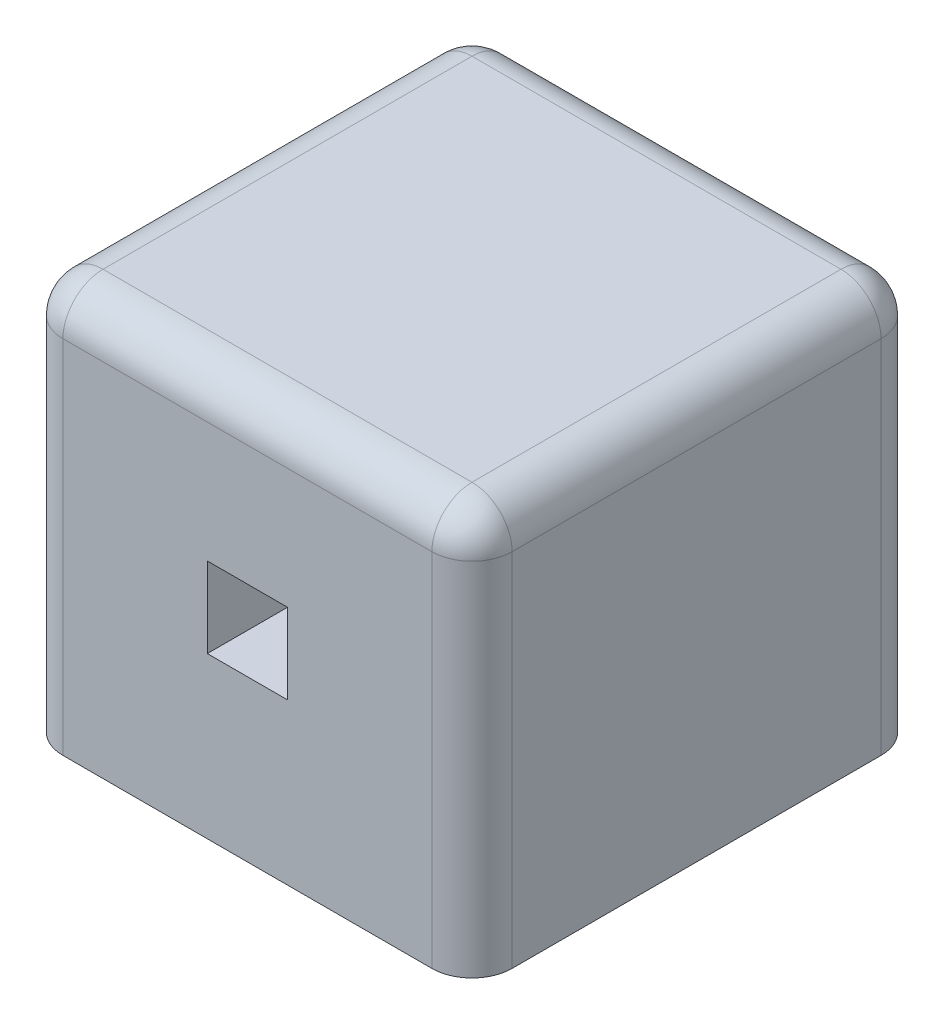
ISO-10303-21;
HEADER;
FILE_DESCRIPTION(('STEP AP214'),'2;1');
FILE_NAME('part.step','',(''),(''),'','','');
FILE_SCHEMA(('AUTOMOTIVE_DESIGN { 1 0 10303 214 1 1 1 1 }'));
ENDSEC;
DATA;
#1=APPLICATION_CONTEXT('core data for automotive mechanical design processes');
#2=APPLICATION_PROTOCOL_DEFINITION('international standard','automotive_design',2000,#1);
#3=PRODUCT_CONTEXT('',#1,'mechanical');
#4=PRODUCT('Part','Part','',(#3));
#5=PRODUCT_RELATED_PRODUCT_CATEGORY('part','',(#4));
#6=PRODUCT_DEFINITION_FORMATION('','',#4);
#7=PRODUCT_DEFINITION_CONTEXT('part definition',#1,'design');
#8=PRODUCT_DEFINITION('design','',#6,#7);
#9=PRODUCT_DEFINITION_SHAPE('','',#8);
#10=(LENGTH_UNIT() NAMED_UNIT(*) SI_UNIT(.MILLI.,.METRE.));
#11=(NAMED_UNIT(*) PLANE_ANGLE_UNIT() SI_UNIT($,.RADIAN.));
#12=(NAMED_UNIT(*) SI_UNIT($,.STERADIAN.) SOLID_ANGLE_UNIT());
#13=UNCERTAINTY_MEASURE_WITH_UNIT(LENGTH_MEASURE(1.E-05),#10,'distance_accuracy_value','');
#14=(GEOMETRIC_REPRESENTATION_CONTEXT(3) GLOBAL_UNCERTAINTY_ASSIGNED_CONTEXT((#13)) GLOBAL_UNIT_ASSIGNED_CONTEXT((#10,
#11,#12)) REPRESENTATION_CONTEXT('',''));
#15=CARTESIAN_POINT('',(0.,0.,0.));
#16=DIRECTION('',(0.,0.,1.));
#17=DIRECTION('',(1.,0.,0.));
#18=AXIS2_PLACEMENT_3D('',#15,#16,#17);
#19=CARTESIAN_POINT('',(0.,0.,80.));
#20=DIRECTION('',(0.,0.,1.));
#21=DIRECTION('',(1.,0.,0.));
#22=AXIS2_PLACEMENT_3D('',#19,#20,#21);
#23=PLANE('',#22);
#24=DIRECTION('',(1.,0.,0.));
#25=VECTOR('',#24,1.);
#26=CARTESIAN_POINT('',(40.,-35.7142857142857,80.));
#27=LINE('',#26,#25);
#28=CARTESIAN_POINT('',(-32.8571428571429,-35.7142857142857,80.));
#29=VERTEX_POINT('',#28);
#30=CARTESIAN_POINT('',(32.8571428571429,-35.7142857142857,80.));
#31=VERTEX_POINT('',#30);
#32=EDGE_CURVE('E197',#29,#31,#27,.T.);
#33=ORIENTED_EDGE('',*,*,#32,.T.);
#34=DIRECTION('',(0.,1.,0.));
#35=VECTOR('',#34,1.);
#36=CARTESIAN_POINT('',(32.8571428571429,35.7142857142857,80.));
#37=LINE('',#36,#35);
#38=CARTESIAN_POINT('',(32.8571428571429,28.5714285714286,80.));
#39=VERTEX_POINT('',#38);
#40=EDGE_CURVE('E250',#31,#39,#37,.T.);
#41=ORIENTED_EDGE('',*,*,#40,.T.);
#42=DIRECTION('',(-1.,0.,0.));
#43=VECTOR('',#42,1.);
#44=CARTESIAN_POINT('',(-40.,28.5714285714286,80.));
#45=LINE('',#44,#43);
#46=CARTESIAN_POINT('',(-32.8571428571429,28.5714285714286,80.));
#47=VERTEX_POINT('',#46);
#48=EDGE_CURVE('E247',#39,#47,#45,.T.);
#49=ORIENTED_EDGE('',*,*,#48,.T.);
#50=DIRECTION('',(0.,-1.,0.));
#51=VECTOR('',#50,1.);
#52=CARTESIAN_POINT('',(-32.8571428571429,-35.7142857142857,80.));
#53=LINE('',#52,#51);
#54=EDGE_CURVE('E244',#47,#29,#53,.T.);
#55=ORIENTED_EDGE('',*,*,#54,.T.);
#56=EDGE_LOOP('',(#33,#41,#49,#55));
#57=FACE_BOUND('',#56,.T.);
#58=DIRECTION('',(1.,0.,0.));
#59=VECTOR('',#58,1.);
#60=CARTESIAN_POINT('',(7.14285714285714,-7.14285714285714,80.));
#61=LINE('',#60,#59);
#62=CARTESIAN_POINT('',(-7.14285714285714,-7.14285714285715,80.));
#63=VERTEX_POINT('',#62);
#64=CARTESIAN_POINT('',(7.14285714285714,-7.14285714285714,80.));
#65=VERTEX_POINT('',#64);
#66=EDGE_CURVE('E153',#63,#65,#61,.T.);
#67=ORIENTED_EDGE('',*,*,#66,.F.);
#68=DIRECTION('',(0.,-1.,0.));
#69=VECTOR('',#68,1.);
#70=CARTESIAN_POINT('',(-7.14285714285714,-7.14285714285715,80.));
#71=LINE('',#70,#69);
#72=CARTESIAN_POINT('',(-7.14285714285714,7.14285714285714,80.));
#73=VERTEX_POINT('',#72);
#74=EDGE_CURVE('E142',#73,#63,#71,.T.);
#75=ORIENTED_EDGE('',*,*,#74,.F.);
#76=DIRECTION('',(-1.,0.,0.));
#77=VECTOR('',#76,1.);
#78=CARTESIAN_POINT('',(7.14285714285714,7.14285714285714,80.));
#79=LINE('',#78,#77);
#80=CARTESIAN_POINT('',(7.14285714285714,7.14285714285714,80.));
#81=VERTEX_POINT('',#80);
#82=EDGE_CURVE('E171',#81,#73,#79,.T.);
#83=ORIENTED_EDGE('',*,*,#82,.F.);
#84=DIRECTION('',(0.,1.,0.));
#85=VECTOR('',#84,1.);
#86=CARTESIAN_POINT('',(7.14285714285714,-7.14285714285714,80.));
#87=LINE('',#86,#85);
#88=EDGE_CURVE('E167',#65,#81,#87,.T.);
#89=ORIENTED_EDGE('',*,*,#88,.F.);
#90=EDGE_LOOP('',(#67,#75,#83,#89));
#91=FACE_BOUND('',#90,.T.);
#92=ADVANCED_FACE('F39',(#57,#91),#23,.T.);
#93=CARTESIAN_POINT('',(0.,0.,0.));
#94=DIRECTION('',(0.,0.,1.));
#95=DIRECTION('',(1.,0.,0.));
#96=AXIS2_PLACEMENT_3D('',#93,#94,#95);
#97=PLANE('',#96);
#98=DIRECTION('',(-1.,0.,0.));
#99=VECTOR('',#98,1.);
#100=CARTESIAN_POINT('',(0.,28.5714285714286,0.));
#101=LINE('',#100,#99);
#102=CARTESIAN_POINT('',(-32.8571428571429,28.5714285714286,0.));
#103=VERTEX_POINT('',#102);
#104=CARTESIAN_POINT('',(32.8571428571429,28.5714285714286,0.));
#105=VERTEX_POINT('',#104);
#106=EDGE_CURVE('E228',#103,#105,#101,.F.);
#107=ORIENTED_EDGE('',*,*,#106,.T.);
#108=DIRECTION('',(0.,1.,0.));
#109=VECTOR('',#108,1.);
#110=CARTESIAN_POINT('',(32.8571428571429,0.,0.));
#111=LINE('',#110,#109);
#112=CARTESIAN_POINT('',(32.8571428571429,-35.7142857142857,0.));
#113=VERTEX_POINT('',#112);
#114=EDGE_CURVE('E232',#105,#113,#111,.F.);
#115=ORIENTED_EDGE('',*,*,#114,.T.);
#116=DIRECTION('',(1.,0.,0.));
#117=VECTOR('',#116,1.);
#118=CARTESIAN_POINT('',(40.,-35.7142857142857,0.));
#119=LINE('',#118,#117);
#120=CARTESIAN_POINT('',(-32.8571428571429,-35.7142857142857,0.));
#121=VERTEX_POINT('',#120);
#122=EDGE_CURVE('E162',#121,#113,#119,.T.);
#123=ORIENTED_EDGE('',*,*,#122,.F.);
#124=DIRECTION('',(0.,-1.,0.));
#125=VECTOR('',#124,1.);
#126=CARTESIAN_POINT('',(-32.8571428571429,0.,0.));
#127=LINE('',#126,#125);
#128=EDGE_CURVE('E225',#121,#103,#127,.F.);
#129=ORIENTED_EDGE('',*,*,#128,.T.);
#130=EDGE_LOOP('',(#107,#115,#123,#129));
#131=FACE_BOUND('',#130,.T.);
#132=DIRECTION('',(0.,-1.,0.));
#133=VECTOR('',#132,1.);
#134=CARTESIAN_POINT('',(-7.14285714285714,-7.14285714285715,0.));
#135=LINE('',#134,#133);
#136=CARTESIAN_POINT('',(-7.14285714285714,7.14285714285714,0.));
#137=VERTEX_POINT('',#136);
#138=CARTESIAN_POINT('',(-7.14285714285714,-7.14285714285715,0.));
#139=VERTEX_POINT('',#138);
#140=EDGE_CURVE('E177',#137,#139,#135,.T.);
#141=ORIENTED_EDGE('',*,*,#140,.T.);
#142=DIRECTION('',(1.,0.,0.));
#143=VECTOR('',#142,1.);
#144=CARTESIAN_POINT('',(7.14285714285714,-7.14285714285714,0.));
#145=LINE('',#144,#143);
#146=CARTESIAN_POINT('',(7.14285714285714,-7.14285714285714,0.));
#147=VERTEX_POINT('',#146);
#148=EDGE_CURVE('E160',#139,#147,#145,.T.);
#149=ORIENTED_EDGE('',*,*,#148,.T.);
#150=DIRECTION('',(0.,1.,0.));
#151=VECTOR('',#150,1.);
#152=CARTESIAN_POINT('',(7.14285714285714,-7.14285714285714,0.));
#153=LINE('',#152,#151);
#154=CARTESIAN_POINT('',(7.14285714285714,7.14285714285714,0.));
#155=VERTEX_POINT('',#154);
#156=EDGE_CURVE('E183',#147,#155,#153,.T.);
#157=ORIENTED_EDGE('',*,*,#156,.T.);
#158=DIRECTION('',(-1.,0.,0.));
#159=VECTOR('',#158,1.);
#160=CARTESIAN_POINT('',(7.14285714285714,7.14285714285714,0.));
#161=LINE('',#160,#159);
#162=EDGE_CURVE('E154',#155,#137,#161,.T.);
#163=ORIENTED_EDGE('',*,*,#162,.T.);
#164=EDGE_LOOP('',(#141,#149,#157,#163));
#165=FACE_BOUND('',#164,.T.);
#166=ADVANCED_FACE('F365',(#131,#165),#97,.F.);
#167=CARTESIAN_POINT('',(-40.,-35.7142857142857,80.));
#168=DIRECTION('',(1.,0.,0.));
#169=DIRECTION('',(0.,0.,-1.));
#170=AXIS2_PLACEMENT_3D('',#167,#168,#169);
#171=PLANE('',#170);
#172=DIRECTION('',(0.,0.,-1.));
#173=VECTOR('',#172,1.);
#174=CARTESIAN_POINT('',(-40.,-35.7142857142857,80.));
#175=LINE('',#174,#173);
#176=CARTESIAN_POINT('',(-40.,-35.7142857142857,72.8571428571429));
#177=VERTEX_POINT('',#176);
#178=CARTESIAN_POINT('',(-40.,-35.7142857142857,7.14285714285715));
#179=VERTEX_POINT('',#178);
#180=EDGE_CURVE('E208',#177,#179,#175,.T.);
#181=ORIENTED_EDGE('',*,*,#180,.F.);
#182=DIRECTION('',(0.,-1.,0.));
#183=VECTOR('',#182,1.);
#184=CARTESIAN_POINT('',(-40.,35.7142857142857,72.8571428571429));
#185=LINE('',#184,#183);
#186=CARTESIAN_POINT('',(-40.,28.5714285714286,72.8571428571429));
#187=VERTEX_POINT('',#186);
#188=EDGE_CURVE('E55',#177,#187,#185,.F.);
#189=ORIENTED_EDGE('',*,*,#188,.T.);
#190=DIRECTION('',(0.,0.,-1.));
#191=VECTOR('',#190,1.);
#192=CARTESIAN_POINT('',(-40.,28.5714285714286,80.));
#193=LINE('',#192,#191);
#194=CARTESIAN_POINT('',(-40.,28.5714285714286,7.14285714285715));
#195=VERTEX_POINT('',#194);
#196=EDGE_CURVE('E60',#187,#195,#193,.T.);
#197=ORIENTED_EDGE('',*,*,#196,.T.);
#198=DIRECTION('',(0.,-1.,0.));
#199=VECTOR('',#198,1.);
#200=CARTESIAN_POINT('',(-40.,-35.7142857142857,7.14285714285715));
#201=LINE('',#200,#199);
#202=EDGE_CURVE('E253',#195,#179,#201,.T.);
#203=ORIENTED_EDGE('',*,*,#202,.T.);
#204=EDGE_LOOP('',(#181,#189,#197,#203));
#205=FACE_BOUND('',#204,.T.);
#206=ADVANCED_FACE('F350',(#205),#171,.F.);
#207=CARTESIAN_POINT('',(40.,-35.7142857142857,80.));
#208=DIRECTION('',(0.,1.,0.));
#209=DIRECTION('',(0.,0.,1.));
#210=AXIS2_PLACEMENT_3D('',#207,#208,#209);
#211=PLANE('',#210);
#212=CARTESIAN_POINT('',(0.,-35.7142857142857,40.));
#213=DIRECTION('',(0.,1.,0.));
#214=DIRECTION('',(0.,0.,1.));
#215=AXIS2_PLACEMENT_3D('',#212,#213,#214);
#216=CIRCLE('',#215,5.);
#217=CARTESIAN_POINT('',(0.,-35.7142857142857,45.));
#218=VERTEX_POINT('',#217);
#219=EDGE_CURVE('E11',#218,#218,#216,.F.);
#220=ORIENTED_EDGE('',*,*,#219,.F.);
#221=EDGE_LOOP('',(#220));
#222=FACE_BOUND('',#221,.T.);
#223=DIRECTION('',(0.,0.,-1.));
#224=VECTOR('',#223,1.);
#225=CARTESIAN_POINT('',(40.,-35.7142857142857,80.));
#226=LINE('',#225,#224);
#227=CARTESIAN_POINT('',(40.,-35.7142857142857,72.8571428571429));
#228=VERTEX_POINT('',#227);
#229=CARTESIAN_POINT('',(40.,-35.7142857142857,7.14285714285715));
#230=VERTEX_POINT('',#229);
#231=EDGE_CURVE('E201',#228,#230,#226,.T.);
#232=ORIENTED_EDGE('',*,*,#231,.F.);
#233=CARTESIAN_POINT('',(32.8571428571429,-35.7142857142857,72.8571428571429));
#234=DIRECTION('',(0.,1.,0.));
#235=DIRECTION('',(0.,0.,1.));
#236=AXIS2_PLACEMENT_3D('',#233,#234,#235);
#237=CIRCLE('',#236,7.14285714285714);
#238=EDGE_CURVE('E48',#228,#31,#237,.F.);
#239=ORIENTED_EDGE('',*,*,#238,.T.);
#240=ORIENTED_EDGE('',*,*,#32,.F.);
#241=CARTESIAN_POINT('',(-32.8571428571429,-35.7142857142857,72.8571428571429));
#242=DIRECTION('',(0.,1.,0.));
#243=DIRECTION('',(0.,0.,1.));
#244=AXIS2_PLACEMENT_3D('',#241,#242,#243);
#245=CIRCLE('',#244,7.14285714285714);
#246=EDGE_CURVE('E266',#29,#177,#245,.F.);
#247=ORIENTED_EDGE('',*,*,#246,.T.);
#248=ORIENTED_EDGE('',*,*,#180,.T.);
#249=CARTESIAN_POINT('',(-32.8571428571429,-35.7142857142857,7.14285714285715));
#250=DIRECTION('',(0.,1.,0.));
#251=DIRECTION('',(0.,0.,1.));
#252=AXIS2_PLACEMENT_3D('',#249,#250,#251);
#253=CIRCLE('',#252,7.14285714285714);
#254=EDGE_CURVE('E260',#179,#121,#253,.F.);
#255=ORIENTED_EDGE('',*,*,#254,.T.);
#256=ORIENTED_EDGE('',*,*,#122,.T.);
#257=CARTESIAN_POINT('',(32.8571428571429,-35.7142857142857,7.14285714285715));
#258=DIRECTION('',(0.,1.,0.));
#259=DIRECTION('',(0.,0.,1.));
#260=AXIS2_PLACEMENT_3D('',#257,#258,#259);
#261=CIRCLE('',#260,7.14285714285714);
#262=EDGE_CURVE('E263',#113,#230,#261,.F.);
#263=ORIENTED_EDGE('',*,*,#262,.T.);
#264=EDGE_LOOP('',(#232,#239,#240,#247,#248,#255,#256,#263));
#265=FACE_BOUND('',#264,.T.);
#266=ADVANCED_FACE('F348',(#222,#265),#211,.F.);
#267=CARTESIAN_POINT('',(40.,-35.7142857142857,80.));
#268=DIRECTION('',(-1.,0.,0.));
#269=DIRECTION('',(0.,0.,1.));
#270=AXIS2_PLACEMENT_3D('',#267,#268,#269);
#271=PLANE('',#270);
#272=DIRECTION('',(0.,0.,-1.));
#273=VECTOR('',#272,1.);
#274=CARTESIAN_POINT('',(40.,28.5714285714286,80.));
#275=LINE('',#274,#273);
#276=CARTESIAN_POINT('',(40.,28.5714285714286,7.14285714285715));
#277=VERTEX_POINT('',#276);
#278=CARTESIAN_POINT('',(40.,28.5714285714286,72.8571428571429));
#279=VERTEX_POINT('',#278);
#280=EDGE_CURVE('E238',#277,#279,#275,.F.);
#281=ORIENTED_EDGE('',*,*,#280,.T.);
#282=DIRECTION('',(0.,1.,0.));
#283=VECTOR('',#282,1.);
#284=CARTESIAN_POINT('',(40.,-35.7142857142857,72.8571428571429));
#285=LINE('',#284,#283);
#286=EDGE_CURVE('E241',#279,#228,#285,.F.);
#287=ORIENTED_EDGE('',*,*,#286,.T.);
#288=ORIENTED_EDGE('',*,*,#231,.T.);
#289=DIRECTION('',(0.,1.,0.));
#290=VECTOR('',#289,1.);
#291=CARTESIAN_POINT('',(40.,-35.7142857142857,7.14285714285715));
#292=LINE('',#291,#290);
#293=EDGE_CURVE('E235',#230,#277,#292,.T.);
#294=ORIENTED_EDGE('',*,*,#293,.T.);
#295=EDGE_LOOP('',(#281,#287,#288,#294));
#296=FACE_BOUND('',#295,.T.);
#297=ADVANCED_FACE('F374',(#296),#271,.F.);
#298=CARTESIAN_POINT('',(40.,35.7142857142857,80.));
#299=DIRECTION('',(0.,-1.,0.));
#300=DIRECTION('',(0.,0.,-1.));
#301=AXIS2_PLACEMENT_3D('',#298,#299,#300);
#302=PLANE('',#301);
#303=DIRECTION('',(0.,0.,-1.));
#304=VECTOR('',#303,1.);
#305=CARTESIAN_POINT('',(32.8571428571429,35.7142857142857,80.));
#306=LINE('',#305,#304);
#307=CARTESIAN_POINT('',(32.8571428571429,35.7142857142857,72.8571428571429));
#308=VERTEX_POINT('',#307);
#309=CARTESIAN_POINT('',(32.8571428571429,35.7142857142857,7.14285714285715));
#310=VERTEX_POINT('',#309);
#311=EDGE_CURVE('E218',#308,#310,#306,.T.);
#312=ORIENTED_EDGE('',*,*,#311,.T.);
#313=DIRECTION('',(-1.,0.,0.));
#314=VECTOR('',#313,1.);
#315=CARTESIAN_POINT('',(40.,35.7142857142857,7.14285714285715));
#316=LINE('',#315,#314);
#317=CARTESIAN_POINT('',(-32.8571428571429,35.7142857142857,7.14285714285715));
#318=VERTEX_POINT('',#317);
#319=EDGE_CURVE('E221',#310,#318,#316,.T.);
#320=ORIENTED_EDGE('',*,*,#319,.T.);
#321=DIRECTION('',(0.,0.,-1.));
#322=VECTOR('',#321,1.);
#323=CARTESIAN_POINT('',(-32.8571428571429,35.7142857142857,80.));
#324=LINE('',#323,#322);
#325=CARTESIAN_POINT('',(-32.8571428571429,35.7142857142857,72.8571428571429));
#326=VERTEX_POINT('',#325);
#327=EDGE_CURVE('E212',#318,#326,#324,.F.);
#328=ORIENTED_EDGE('',*,*,#327,.T.);
#329=DIRECTION('',(-1.,0.,0.));
#330=VECTOR('',#329,1.);
#331=CARTESIAN_POINT('',(40.,35.7142857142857,72.8571428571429));
#332=LINE('',#331,#330);
#333=EDGE_CURVE('E215',#326,#308,#332,.F.);
#334=ORIENTED_EDGE('',*,*,#333,.T.);
#335=EDGE_LOOP('',(#312,#320,#328,#334));
#336=FACE_BOUND('',#335,.T.);
#337=ADVANCED_FACE('F331',(#336),#302,.F.);
#338=CARTESIAN_POINT('',(-7.14285714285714,-7.14285714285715,80.));
#339=DIRECTION('',(1.,0.,0.));
#340=DIRECTION('',(0.,0.,-1.));
#341=AXIS2_PLACEMENT_3D('',#338,#339,#340);
#342=PLANE('',#341);
#343=ORIENTED_EDGE('',*,*,#140,.F.);
#344=DIRECTION('',(0.,0.,-1.));
#345=VECTOR('',#344,1.);
#346=CARTESIAN_POINT('',(-7.14285714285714,7.14285714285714,80.));
#347=LINE('',#346,#345);
#348=EDGE_CURVE('E148',#73,#137,#347,.T.);
#349=ORIENTED_EDGE('',*,*,#348,.F.);
#350=ORIENTED_EDGE('',*,*,#74,.T.);
#351=DIRECTION('',(0.,0.,-1.));
#352=VECTOR('',#351,1.);
#353=CARTESIAN_POINT('',(-7.14285714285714,-7.14285714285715,80.));
#354=LINE('',#353,#352);
#355=EDGE_CURVE('E145',#63,#139,#354,.T.);
#356=ORIENTED_EDGE('',*,*,#355,.T.);
#357=EDGE_LOOP('',(#343,#349,#350,#356));
#358=FACE_BOUND('',#357,.T.);
#359=ADVANCED_FACE('F144',(#358),#342,.T.);
#360=CARTESIAN_POINT('',(7.14285714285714,-7.14285714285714,80.));
#361=DIRECTION('',(0.,1.,0.));
#362=DIRECTION('',(-1.,0.,0.));
#363=AXIS2_PLACEMENT_3D('',#360,#361,#362);
#364=PLANE('',#363);
#365=ORIENTED_EDGE('',*,*,#148,.F.);
#366=ORIENTED_EDGE('',*,*,#355,.F.);
#367=ORIENTED_EDGE('',*,*,#66,.T.);
#368=DIRECTION('',(0.,0.,-1.));
#369=VECTOR('',#368,1.);
#370=CARTESIAN_POINT('',(7.14285714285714,-7.14285714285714,80.));
#371=LINE('',#370,#369);
#372=EDGE_CURVE('E163',#65,#147,#371,.T.);
#373=ORIENTED_EDGE('',*,*,#372,.T.);
#374=EDGE_LOOP('',(#365,#366,#367,#373));
#375=FACE_BOUND('',#374,.T.);
#376=ADVANCED_FACE('F157',(#375),#364,.T.);
#377=CARTESIAN_POINT('',(7.14285714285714,-7.14285714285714,80.));
#378=DIRECTION('',(-1.,0.,0.));
#379=DIRECTION('',(0.,0.,1.));
#380=AXIS2_PLACEMENT_3D('',#377,#378,#379);
#381=PLANE('',#380);
#382=ORIENTED_EDGE('',*,*,#156,.F.);
#383=ORIENTED_EDGE('',*,*,#372,.F.);
#384=ORIENTED_EDGE('',*,*,#88,.T.);
#385=DIRECTION('',(0.,0.,-1.));
#386=VECTOR('',#385,1.);
#387=CARTESIAN_POINT('',(7.14285714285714,7.14285714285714,80.));
#388=LINE('',#387,#386);
#389=EDGE_CURVE('E192',#81,#155,#388,.T.);
#390=ORIENTED_EDGE('',*,*,#389,.T.);
#391=EDGE_LOOP('',(#382,#383,#384,#390));
#392=FACE_BOUND('',#391,.T.);
#393=ADVANCED_FACE('F382',(#392),#381,.T.);
#394=CARTESIAN_POINT('',(7.14285714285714,7.14285714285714,80.));
#395=DIRECTION('',(0.,-1.,0.));
#396=DIRECTION('',(1.,0.,0.));
#397=AXIS2_PLACEMENT_3D('',#394,#395,#396);
#398=PLANE('',#397);
#399=ORIENTED_EDGE('',*,*,#162,.F.);
#400=ORIENTED_EDGE('',*,*,#389,.F.);
#401=ORIENTED_EDGE('',*,*,#82,.T.);
#402=ORIENTED_EDGE('',*,*,#348,.T.);
#403=EDGE_LOOP('',(#399,#400,#401,#402));
#404=FACE_BOUND('',#403,.T.);
#405=ADVANCED_FACE('F377',(#404),#398,.T.);
#406=CARTESIAN_POINT('',(32.8571428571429,0.,72.8571428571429));
#407=DIRECTION('',(0.,-1.,0.));
#408=DIRECTION('',(0.,0.,-1.));
#409=AXIS2_PLACEMENT_3D('',#406,#407,#408);
#410=CYLINDRICAL_SURFACE('',#409,7.14285714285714);
#411=ORIENTED_EDGE('',*,*,#238,.F.);
#412=ORIENTED_EDGE('',*,*,#286,.F.);
#413=CARTESIAN_POINT('',(32.8571428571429,28.5714285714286,72.8571428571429));
#414=DIRECTION('',(0.,1.,0.));
#415=DIRECTION('',(0.,0.,1.));
#416=AXIS2_PLACEMENT_3D('',#413,#414,#415);
#417=CIRCLE('',#416,7.14285714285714);
#418=EDGE_CURVE('E180',#39,#279,#417,.T.);
#419=ORIENTED_EDGE('',*,*,#418,.F.);
#420=ORIENTED_EDGE('',*,*,#40,.F.);
#421=EDGE_LOOP('',(#411,#412,#419,#420));
#422=FACE_BOUND('',#421,.T.);
#423=ADVANCED_FACE('F41',(#422),#410,.T.);
#424=CARTESIAN_POINT('',(0.,28.5714285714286,72.8571428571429));
#425=DIRECTION('',(1.,0.,0.));
#426=DIRECTION('',(0.,0.,-1.));
#427=AXIS2_PLACEMENT_3D('',#424,#425,#426);
#428=CYLINDRICAL_SURFACE('',#427,7.14285714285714);
#429=CARTESIAN_POINT('',(-32.8571428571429,28.5714285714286,72.8571428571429));
#430=DIRECTION('',(-1.,0.,0.));
#431=DIRECTION('',(0.,0.,1.));
#432=AXIS2_PLACEMENT_3D('',#429,#430,#431);
#433=CIRCLE('',#432,7.14285714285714);
#434=EDGE_CURVE('E306',#47,#326,#433,.T.);
#435=ORIENTED_EDGE('',*,*,#434,.F.);
#436=ORIENTED_EDGE('',*,*,#48,.F.);
#437=CARTESIAN_POINT('',(32.8571428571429,28.5714285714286,72.8571428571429));
#438=DIRECTION('',(1.,0.,0.));
#439=DIRECTION('',(0.,0.,-1.));
#440=AXIS2_PLACEMENT_3D('',#437,#438,#439);
#441=CIRCLE('',#440,7.14285714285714);
#442=EDGE_CURVE('E310',#308,#39,#441,.T.);
#443=ORIENTED_EDGE('',*,*,#442,.F.);
#444=ORIENTED_EDGE('',*,*,#333,.F.);
#445=EDGE_LOOP('',(#435,#436,#443,#444));
#446=FACE_BOUND('',#445,.T.);
#447=ADVANCED_FACE('F338',(#446),#428,.T.);
#448=CARTESIAN_POINT('',(-32.8571428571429,0.,72.8571428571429));
#449=DIRECTION('',(0.,1.,0.));
#450=DIRECTION('',(0.,0.,1.));
#451=AXIS2_PLACEMENT_3D('',#448,#449,#450);
#452=CYLINDRICAL_SURFACE('',#451,7.14285714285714);
#453=ORIENTED_EDGE('',*,*,#246,.F.);
#454=ORIENTED_EDGE('',*,*,#54,.F.);
#455=CARTESIAN_POINT('',(-32.8571428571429,28.5714285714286,72.8571428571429));
#456=DIRECTION('',(0.,1.,0.));
#457=DIRECTION('',(0.,0.,1.));
#458=AXIS2_PLACEMENT_3D('',#455,#456,#457);
#459=CIRCLE('',#458,7.14285714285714);
#460=EDGE_CURVE('E302',#187,#47,#459,.T.);
#461=ORIENTED_EDGE('',*,*,#460,.F.);
#462=ORIENTED_EDGE('',*,*,#188,.F.);
#463=EDGE_LOOP('',(#453,#454,#461,#462));
#464=FACE_BOUND('',#463,.T.);
#465=ADVANCED_FACE('F344',(#464),#452,.T.);
#466=CARTESIAN_POINT('',(32.8571428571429,28.5714285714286,72.8571428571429));
#467=DIRECTION('',(0.,0.,1.));
#468=DIRECTION('',(1.,0.,0.));
#469=AXIS2_PLACEMENT_3D('',#466,#467,#468);
#470=SPHERICAL_SURFACE('',#469,7.14285714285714);
#471=ORIENTED_EDGE('',*,*,#442,.T.);
#472=ORIENTED_EDGE('',*,*,#418,.T.);
#473=CARTESIAN_POINT('',(32.8571428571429,28.5714285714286,72.8571428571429));
#474=DIRECTION('',(0.,0.,1.));
#475=DIRECTION('',(1.,0.,0.));
#476=AXIS2_PLACEMENT_3D('',#473,#474,#475);
#477=CIRCLE('',#476,7.14285714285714);
#478=EDGE_CURVE('E298',#308,#279,#477,.F.);
#479=ORIENTED_EDGE('',*,*,#478,.F.);
#480=EDGE_LOOP('',(#471,#472,#479));
#481=FACE_BOUND('',#480,.T.);
#482=ADVANCED_FACE('F318',(#481),#470,.T.);
#483=CARTESIAN_POINT('',(-32.8571428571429,28.5714285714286,72.8571428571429));
#484=DIRECTION('',(0.,0.,1.));
#485=DIRECTION('',(1.,0.,0.));
#486=AXIS2_PLACEMENT_3D('',#483,#484,#485);
#487=SPHERICAL_SURFACE('',#486,7.14285714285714);
#488=ORIENTED_EDGE('',*,*,#460,.T.);
#489=ORIENTED_EDGE('',*,*,#434,.T.);
#490=CARTESIAN_POINT('',(-32.8571428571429,28.5714285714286,72.8571428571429));
#491=DIRECTION('',(0.,0.,1.));
#492=DIRECTION('',(1.,0.,0.));
#493=AXIS2_PLACEMENT_3D('',#490,#491,#492);
#494=CIRCLE('',#493,7.14285714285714);
#495=EDGE_CURVE('E294',#187,#326,#494,.F.);
#496=ORIENTED_EDGE('',*,*,#495,.F.);
#497=EDGE_LOOP('',(#488,#489,#496));
#498=FACE_BOUND('',#497,.T.);
#499=ADVANCED_FACE('F420',(#498),#487,.T.);
#500=CARTESIAN_POINT('',(32.8571428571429,-35.7142857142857,7.14285714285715));
#501=DIRECTION('',(0.,1.,0.));
#502=DIRECTION('',(0.,0.,1.));
#503=AXIS2_PLACEMENT_3D('',#500,#501,#502);
#504=CYLINDRICAL_SURFACE('',#503,7.14285714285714);
#505=ORIENTED_EDGE('',*,*,#262,.F.);
#506=ORIENTED_EDGE('',*,*,#114,.F.);
#507=CARTESIAN_POINT('',(32.8571428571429,28.5714285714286,7.14285714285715));
#508=DIRECTION('',(0.,1.,0.));
#509=DIRECTION('',(0.,0.,1.));
#510=AXIS2_PLACEMENT_3D('',#507,#508,#509);
#511=CIRCLE('',#510,7.14285714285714);
#512=EDGE_CURVE('E290',#277,#105,#511,.T.);
#513=ORIENTED_EDGE('',*,*,#512,.F.);
#514=ORIENTED_EDGE('',*,*,#293,.F.);
#515=EDGE_LOOP('',(#505,#506,#513,#514));
#516=FACE_BOUND('',#515,.T.);
#517=ADVANCED_FACE('F372',(#516),#504,.T.);
#518=CARTESIAN_POINT('',(32.8571428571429,28.5714285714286,80.));
#519=DIRECTION('',(0.,0.,-1.));
#520=DIRECTION('',(-1.,0.,0.));
#521=AXIS2_PLACEMENT_3D('',#518,#519,#520);
#522=CYLINDRICAL_SURFACE('',#521,7.14285714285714);
#523=ORIENTED_EDGE('',*,*,#478,.T.);
#524=ORIENTED_EDGE('',*,*,#280,.F.);
#525=CARTESIAN_POINT('',(32.8571428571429,28.5714285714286,7.14285714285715));
#526=DIRECTION('',(0.,0.,-1.));
#527=DIRECTION('',(-1.,0.,0.));
#528=AXIS2_PLACEMENT_3D('',#525,#526,#527);
#529=CIRCLE('',#528,7.14285714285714);
#530=EDGE_CURVE('E286',#310,#277,#529,.T.);
#531=ORIENTED_EDGE('',*,*,#530,.F.);
#532=ORIENTED_EDGE('',*,*,#311,.F.);
#533=EDGE_LOOP('',(#523,#524,#531,#532));
#534=FACE_BOUND('',#533,.T.);
#535=ADVANCED_FACE('F326',(#534),#522,.T.);
#536=CARTESIAN_POINT('',(-32.8571428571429,28.5714285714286,80.));
#537=DIRECTION('',(0.,0.,-1.));
#538=DIRECTION('',(-1.,0.,0.));
#539=AXIS2_PLACEMENT_3D('',#536,#537,#538);
#540=CYLINDRICAL_SURFACE('',#539,7.14285714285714);
#541=ORIENTED_EDGE('',*,*,#495,.T.);
#542=ORIENTED_EDGE('',*,*,#327,.F.);
#543=CARTESIAN_POINT('',(-32.8571428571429,28.5714285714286,7.14285714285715));
#544=DIRECTION('',(0.,0.,-1.));
#545=DIRECTION('',(-1.,0.,0.));
#546=AXIS2_PLACEMENT_3D('',#543,#544,#545);
#547=CIRCLE('',#546,7.14285714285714);
#548=EDGE_CURVE('E282',#195,#318,#547,.T.);
#549=ORIENTED_EDGE('',*,*,#548,.F.);
#550=ORIENTED_EDGE('',*,*,#196,.F.);
#551=EDGE_LOOP('',(#541,#542,#549,#550));
#552=FACE_BOUND('',#551,.T.);
#553=ADVANCED_FACE('F358',(#552),#540,.T.);
#554=CARTESIAN_POINT('',(-32.8571428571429,-35.7142857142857,7.14285714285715));
#555=DIRECTION('',(0.,-1.,0.));
#556=DIRECTION('',(0.,0.,-1.));
#557=AXIS2_PLACEMENT_3D('',#554,#555,#556);
#558=CYLINDRICAL_SURFACE('',#557,7.14285714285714);
#559=ORIENTED_EDGE('',*,*,#254,.F.);
#560=ORIENTED_EDGE('',*,*,#202,.F.);
#561=CARTESIAN_POINT('',(-32.8571428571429,28.5714285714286,7.14285714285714));
#562=DIRECTION('',(0.,1.,0.));
#563=DIRECTION('',(0.,0.,1.));
#564=AXIS2_PLACEMENT_3D('',#561,#562,#563);
#565=CIRCLE('',#564,7.14285714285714);
#566=EDGE_CURVE('E278',#103,#195,#565,.T.);
#567=ORIENTED_EDGE('',*,*,#566,.F.);
#568=ORIENTED_EDGE('',*,*,#128,.F.);
#569=EDGE_LOOP('',(#559,#560,#567,#568));
#570=FACE_BOUND('',#569,.T.);
#571=ADVANCED_FACE('F354',(#570),#558,.T.);
#572=CARTESIAN_POINT('',(32.8571428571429,28.5714285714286,7.14285714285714));
#573=DIRECTION('',(1.,0.,0.));
#574=DIRECTION('',(0.,0.,-1.));
#575=AXIS2_PLACEMENT_3D('',#572,#573,#574);
#576=SPHERICAL_SURFACE('',#575,7.14285714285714);
#577=ORIENTED_EDGE('',*,*,#530,.T.);
#578=ORIENTED_EDGE('',*,*,#512,.T.);
#579=CARTESIAN_POINT('',(32.8571428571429,28.5714285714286,7.14285714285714));
#580=DIRECTION('',(1.,0.,0.));
#581=DIRECTION('',(0.,0.,-1.));
#582=AXIS2_PLACEMENT_3D('',#579,#580,#581);
#583=CIRCLE('',#582,7.14285714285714);
#584=EDGE_CURVE('E274',#310,#105,#583,.F.);
#585=ORIENTED_EDGE('',*,*,#584,.F.);
#586=EDGE_LOOP('',(#577,#578,#585));
#587=FACE_BOUND('',#586,.T.);
#588=ADVANCED_FACE('F408',(#587),#576,.T.);
#589=CARTESIAN_POINT('',(-32.8571428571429,28.5714285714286,7.14285714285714));
#590=DIRECTION('',(-1.,0.,0.));
#591=DIRECTION('',(0.,0.,1.));
#592=AXIS2_PLACEMENT_3D('',#589,#590,#591);
#593=SPHERICAL_SURFACE('',#592,7.14285714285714);
#594=ORIENTED_EDGE('',*,*,#566,.T.);
#595=ORIENTED_EDGE('',*,*,#548,.T.);
#596=CARTESIAN_POINT('',(-32.8571428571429,28.5714285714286,7.14285714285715));
#597=DIRECTION('',(-1.,0.,0.));
#598=DIRECTION('',(0.,0.,1.));
#599=AXIS2_PLACEMENT_3D('',#596,#597,#598);
#600=CIRCLE('',#599,7.14285714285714);
#601=EDGE_CURVE('E271',#103,#318,#600,.F.);
#602=ORIENTED_EDGE('',*,*,#601,.F.);
#603=EDGE_LOOP('',(#594,#595,#602));
#604=FACE_BOUND('',#603,.T.);
#605=ADVANCED_FACE('F361',(#604),#593,.T.);
#606=CARTESIAN_POINT('',(40.,28.5714285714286,7.14285714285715));
#607=DIRECTION('',(-1.,0.,0.));
#608=DIRECTION('',(0.,0.,1.));
#609=AXIS2_PLACEMENT_3D('',#606,#607,#608);
#610=CYLINDRICAL_SURFACE('',#609,7.14285714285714);
#611=ORIENTED_EDGE('',*,*,#584,.T.);
#612=ORIENTED_EDGE('',*,*,#106,.F.);
#613=ORIENTED_EDGE('',*,*,#601,.T.);
#614=ORIENTED_EDGE('',*,*,#319,.F.);
#615=EDGE_LOOP('',(#611,#612,#613,#614));
#616=FACE_BOUND('',#615,.T.);
#617=ADVANCED_FACE('F363',(#616),#610,.T.);
#618=CARTESIAN_POINT('',(0.,-41.7142857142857,40.));
#619=DIRECTION('',(0.,1.,0.));
#620=DIRECTION('',(0.,0.,1.));
#621=AXIS2_PLACEMENT_3D('',#618,#619,#620);
#622=CYLINDRICAL_SURFACE('',#621,5.);
#623=CARTESIAN_POINT('',(0.,-41.7142857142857,40.));
#624=DIRECTION('',(0.,-1.,0.));
#625=DIRECTION('',(0.,0.,-1.));
#626=AXIS2_PLACEMENT_3D('',#623,#624,#625);
#627=CIRCLE('',#626,5.);
#628=CARTESIAN_POINT('',(0.,-41.7142857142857,35.));
#629=VERTEX_POINT('',#628);
#630=EDGE_CURVE('E275',#629,#629,#627,.T.);
#631=ORIENTED_EDGE('',*,*,#630,.F.);
#632=EDGE_LOOP('',(#631));
#633=FACE_BOUND('',#632,.T.);
#634=ORIENTED_EDGE('',*,*,#219,.T.);
#635=EDGE_LOOP('',(#634));
#636=FACE_BOUND('',#635,.T.);
#637=ADVANCED_FACE('F405',(#633,#636),#622,.T.);
#638=CARTESIAN_POINT('',(0.,-41.7142857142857,40.));
#639=DIRECTION('',(0.,-1.,0.));
#640=DIRECTION('',(0.,0.,-1.));
#641=AXIS2_PLACEMENT_3D('',#638,#639,#640);
#642=PLANE('',#641);
#643=ORIENTED_EDGE('',*,*,#630,.T.);
#644=EDGE_LOOP('',(#643));
#645=FACE_BOUND('',#644,.T.);
#646=ADVANCED_FACE('F473',(#645),#642,.T.);
#647=CLOSED_SHELL('',(#92,#166,#206,#266,#297,#337,#359,#376,#393,#405,#423,#447,#465,#482,#499,
#517,#535,#553,#571,#588,#605,#617,#637,#646));
#648=MANIFOLD_SOLID_BREP('B2',#647);
#649=ADVANCED_BREP_SHAPE_REPRESENTATION('',(#18,#648),#14);
#650=SHAPE_DEFINITION_REPRESENTATION(#9,#649);
ENDSEC;
END-ISO-10303-21;
